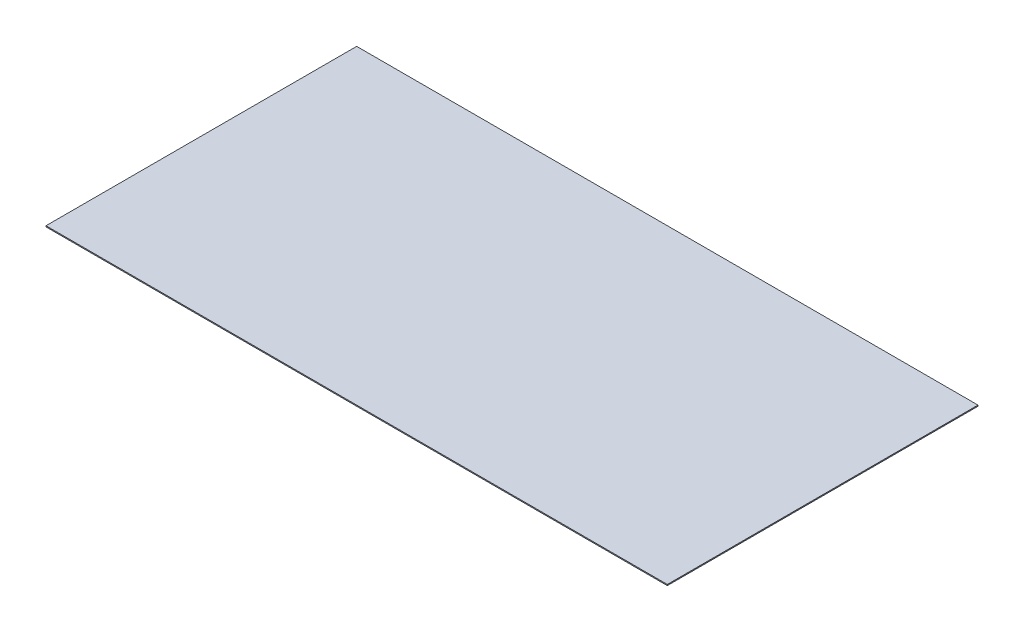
from build123d import *

# Parameters (mm, degrees)
SKETCH1_W           = 914.4
SKETCH1_H           = 457.2
BOSS_EXTRUDE1_DEPTH = 1.524


with BuildPart() as part:
    # Sketch1 → Boss-Extrude1 (new body)
    with BuildSketch(Plane(origin=(0, 0, 0), x_dir=(1, 0, 0), z_dir=(0, 1, 0))):
        with Locations((457.2, 228.6)):
            Rectangle(SKETCH1_W, SKETCH1_H)
    extrude(amount=BOSS_EXTRUDE1_DEPTH)


solid = part.part
